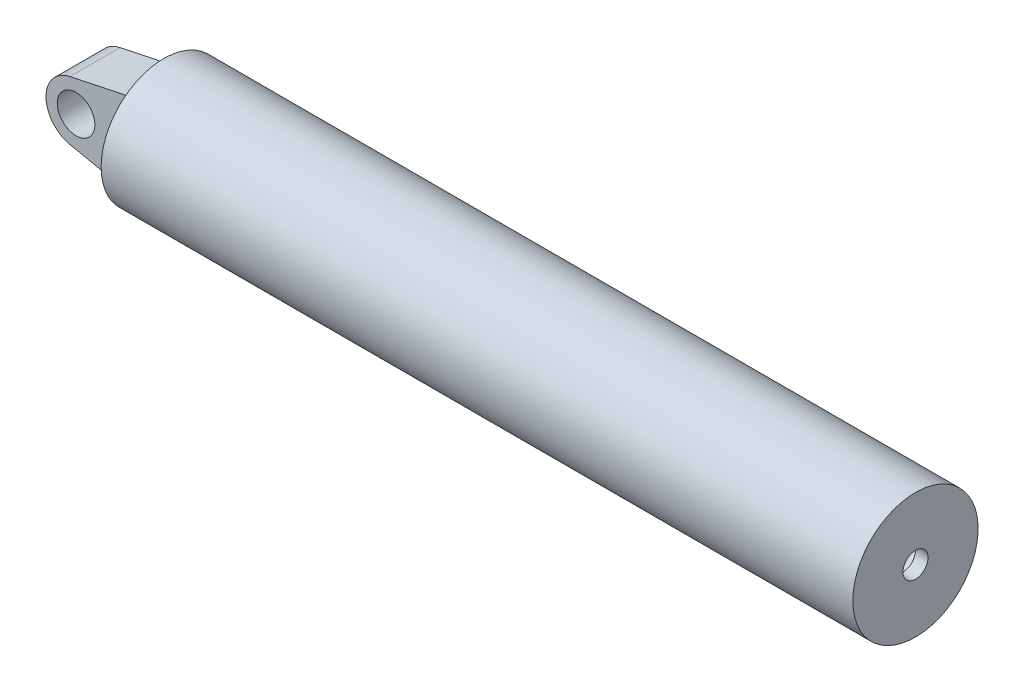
ISO-10303-21;
HEADER;
FILE_DESCRIPTION(('STEP AP214'),'2;1');
FILE_NAME('part.step','',(''),(''),'','','');
FILE_SCHEMA(('AUTOMOTIVE_DESIGN { 1 0 10303 214 1 1 1 1 }'));
ENDSEC;
DATA;
#1=APPLICATION_CONTEXT('core data for automotive mechanical design processes');
#2=APPLICATION_PROTOCOL_DEFINITION('international standard','automotive_design',2000,#1);
#3=PRODUCT_CONTEXT('',#1,'mechanical');
#4=PRODUCT('Part','Part','',(#3));
#5=PRODUCT_RELATED_PRODUCT_CATEGORY('part','',(#4));
#6=PRODUCT_DEFINITION_FORMATION('','',#4);
#7=PRODUCT_DEFINITION_CONTEXT('part definition',#1,'design');
#8=PRODUCT_DEFINITION('design','',#6,#7);
#9=PRODUCT_DEFINITION_SHAPE('','',#8);
#10=(LENGTH_UNIT() NAMED_UNIT(*) SI_UNIT(.MILLI.,.METRE.));
#11=(NAMED_UNIT(*) PLANE_ANGLE_UNIT() SI_UNIT($,.RADIAN.));
#12=(NAMED_UNIT(*) SI_UNIT($,.STERADIAN.) SOLID_ANGLE_UNIT());
#13=UNCERTAINTY_MEASURE_WITH_UNIT(LENGTH_MEASURE(1.E-05),#10,'distance_accuracy_value','');
#14=(GEOMETRIC_REPRESENTATION_CONTEXT(3) GLOBAL_UNCERTAINTY_ASSIGNED_CONTEXT((#13)) GLOBAL_UNIT_ASSIGNED_CONTEXT((#10,
#11,#12)) REPRESENTATION_CONTEXT('',''));
#15=CARTESIAN_POINT('',(0.,0.,0.));
#16=DIRECTION('',(0.,0.,1.));
#17=DIRECTION('',(1.,0.,0.));
#18=AXIS2_PLACEMENT_3D('',#15,#16,#17);
#19=CARTESIAN_POINT('',(-25.0000000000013,-1.71543922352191,9.99999999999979));
#20=DIRECTION('',(0.,0.,1.00000000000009));
#21=DIRECTION('',(1.00000000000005,0.,0.));
#22=AXIS2_PLACEMENT_3D('',#19,#20,#21);
#23=PLANE('',#22);
#24=DIRECTION('',(0.,-1.00000000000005,0.));
#25=VECTOR('',#24,1.);
#26=CARTESIAN_POINT('',(0.,15.7845607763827,9.99999999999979));
#27=LINE('',#26,#25);
#28=CARTESIAN_POINT('',(0.,15.7845607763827,9.99999999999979));
#29=VERTEX_POINT('',#28);
#30=CARTESIAN_POINT('',(-1.17961196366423E-12,-19.2154392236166,9.99999999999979));
#31=VERTEX_POINT('',#30);
#32=EDGE_CURVE('E33',#29,#31,#27,.T.);
#33=ORIENTED_EDGE('',*,*,#32,.F.);
#34=DIRECTION('',(-0.978737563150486,-0.205116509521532,0.));
#35=VECTOR('',#34,1.);
#36=CARTESIAN_POINT('',(0.,15.7845607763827,9.99999999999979));
#37=LINE('',#36,#35);
#38=CARTESIAN_POINT('',(-27.4613958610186,10.0294065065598,9.99999999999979));
#39=VERTEX_POINT('',#38);
#40=EDGE_CURVE('E59',#29,#39,#37,.T.);
#41=ORIENTED_EDGE('',*,*,#40,.T.);
#42=CARTESIAN_POINT('',(-25.0000000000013,-1.71543922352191,9.99999999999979));
#43=DIRECTION('',(0.,0.,1.00000000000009));
#44=DIRECTION('',(1.00000000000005,0.,0.));
#45=AXIS2_PLACEMENT_3D('',#42,#43,#44);
#46=CIRCLE('',#45,12.);
#47=CARTESIAN_POINT('',(-27.4613947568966,-13.4602906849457,9.99999999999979));
#48=VERTEX_POINT('',#47);
#49=EDGE_CURVE('E83',#39,#48,#46,.T.);
#50=ORIENTED_EDGE('',*,*,#49,.T.);
#51=DIRECTION('',(-0.978737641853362,0.20511613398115,0.));
#52=VECTOR('',#51,1.);
#53=CARTESIAN_POINT('',(-1.17961196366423E-12,-19.2154392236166,9.99999999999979));
#54=LINE('',#53,#52);
#55=EDGE_CURVE('E81',#31,#48,#54,.T.);
#56=ORIENTED_EDGE('',*,*,#55,.F.);
#57=EDGE_LOOP('',(#33,#41,#50,#56));
#58=FACE_BOUND('',#57,.T.);
#59=CARTESIAN_POINT('',(-25.0000000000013,-1.71543922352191,9.99999999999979));
#60=DIRECTION('',(0.,0.,1.00000000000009));
#61=DIRECTION('',(1.00000000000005,0.,0.));
#62=AXIS2_PLACEMENT_3D('',#59,#60,#61);
#63=CIRCLE('',#62,7.5);
#64=CARTESIAN_POINT('',(-17.5000000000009,-1.71543922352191,9.99999999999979));
#65=VERTEX_POINT('',#64);
#66=EDGE_CURVE('E71',#65,#65,#63,.T.);
#67=ORIENTED_EDGE('',*,*,#66,.F.);
#68=EDGE_LOOP('',(#67));
#69=FACE_BOUND('',#68,.T.);
#70=ADVANCED_FACE('F14',(#58,#69),#23,.T.);
#71=CARTESIAN_POINT('',(-25.0000000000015,-1.71543922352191,-9.99999999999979));
#72=DIRECTION('',(0.,0.,1.00000000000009));
#73=DIRECTION('',(1.00000000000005,0.,0.));
#74=AXIS2_PLACEMENT_3D('',#71,#72,#73);
#75=PLANE('',#74);
#76=DIRECTION('',(0.,-1.00000000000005,0.));
#77=VECTOR('',#76,1.);
#78=CARTESIAN_POINT('',(0.,15.7845607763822,-9.99999999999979));
#79=LINE('',#78,#77);
#80=CARTESIAN_POINT('',(0.,15.7845607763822,-9.99999999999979));
#81=VERTEX_POINT('',#80);
#82=CARTESIAN_POINT('',(-1.40165656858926E-12,-19.2154392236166,-9.99999999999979));
#83=VERTEX_POINT('',#82);
#84=EDGE_CURVE('E53',#81,#83,#79,.T.);
#85=ORIENTED_EDGE('',*,*,#84,.T.);
#86=DIRECTION('',(-0.978737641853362,0.20511613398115,0.));
#87=VECTOR('',#86,1.);
#88=CARTESIAN_POINT('',(-1.40165656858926E-12,-19.2154392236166,-9.99999999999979));
#89=LINE('',#88,#87);
#90=CARTESIAN_POINT('',(-27.4613947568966,-13.4602906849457,-9.99999999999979));
#91=VERTEX_POINT('',#90);
#92=EDGE_CURVE('E67',#83,#91,#89,.T.);
#93=ORIENTED_EDGE('',*,*,#92,.T.);
#94=CARTESIAN_POINT('',(-25.0000000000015,-1.71543922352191,-9.99999999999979));
#95=DIRECTION('',(0.,0.,1.00000000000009));
#96=DIRECTION('',(1.00000000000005,0.,0.));
#97=AXIS2_PLACEMENT_3D('',#94,#95,#96);
#98=CIRCLE('',#97,12.);
#99=CARTESIAN_POINT('',(-27.4613958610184,10.0294065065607,-9.99999999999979));
#100=VERTEX_POINT('',#99);
#101=EDGE_CURVE('E74',#100,#91,#98,.T.);
#102=ORIENTED_EDGE('',*,*,#101,.F.);
#103=DIRECTION('',(-0.978737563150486,-0.205116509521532,0.));
#104=VECTOR('',#103,1.);
#105=CARTESIAN_POINT('',(0.,15.7845607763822,-9.99999999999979));
#106=LINE('',#105,#104);
#107=EDGE_CURVE('E70',#81,#100,#106,.T.);
#108=ORIENTED_EDGE('',*,*,#107,.F.);
#109=EDGE_LOOP('',(#85,#93,#102,#108));
#110=FACE_BOUND('',#109,.T.);
#111=CARTESIAN_POINT('',(-25.0000000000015,-1.71543922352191,-9.99999999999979));
#112=DIRECTION('',(0.,0.,1.00000000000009));
#113=DIRECTION('',(1.00000000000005,0.,0.));
#114=AXIS2_PLACEMENT_3D('',#111,#112,#113);
#115=CIRCLE('',#114,7.5);
#116=CARTESIAN_POINT('',(-17.5000000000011,-1.71543922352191,-9.99999999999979));
#117=VERTEX_POINT('',#116);
#118=EDGE_CURVE('E247',#117,#117,#115,.T.);
#119=ORIENTED_EDGE('',*,*,#118,.T.);
#120=EDGE_LOOP('',(#119));
#121=FACE_BOUND('',#120,.T.);
#122=ADVANCED_FACE('F64',(#110,#121),#75,.F.);
#123=CARTESIAN_POINT('',(0.,15.7845607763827,9.99999999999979));
#124=DIRECTION('',(0.205116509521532,-0.978737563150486,0.));
#125=DIRECTION('',(0.978737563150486,0.205116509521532,0.));
#126=AXIS2_PLACEMENT_3D('',#123,#124,#125);
#127=PLANE('',#126);
#128=DIRECTION('',(0.,0.,-1.00000000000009));
#129=VECTOR('',#128,1.);
#130=CARTESIAN_POINT('',(-27.4613958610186,10.0294065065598,9.99999999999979));
#131=LINE('',#130,#129);
#132=EDGE_CURVE('E89',#39,#100,#131,.T.);
#133=ORIENTED_EDGE('',*,*,#132,.F.);
#134=ORIENTED_EDGE('',*,*,#40,.F.);
#135=DIRECTION('',(0.,0.,-1.00000000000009));
#136=VECTOR('',#135,1.);
#137=CARTESIAN_POINT('',(0.,15.7845607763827,9.99999999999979));
#138=LINE('',#137,#136);
#139=EDGE_CURVE('E29',#29,#81,#138,.T.);
#140=ORIENTED_EDGE('',*,*,#139,.T.);
#141=ORIENTED_EDGE('',*,*,#107,.T.);
#142=EDGE_LOOP('',(#133,#134,#140,#141));
#143=FACE_BOUND('',#142,.T.);
#144=ADVANCED_FACE('F128',(#143),#127,.F.);
#145=CARTESIAN_POINT('',(-25.0000000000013,-1.71543922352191,9.99999999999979));
#146=DIRECTION('',(0.,0.,-1.00000000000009));
#147=DIRECTION('',(-1.00000000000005,0.,0.));
#148=AXIS2_PLACEMENT_3D('',#145,#146,#147);
#149=CYLINDRICAL_SURFACE('',#148,12.);
#150=DIRECTION('',(0.,0.,-1.00000000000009));
#151=VECTOR('',#150,1.);
#152=CARTESIAN_POINT('',(-27.4613947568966,-13.4602906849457,9.99999999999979));
#153=LINE('',#152,#151);
#154=EDGE_CURVE('E58',#48,#91,#153,.T.);
#155=ORIENTED_EDGE('',*,*,#154,.F.);
#156=ORIENTED_EDGE('',*,*,#49,.F.);
#157=ORIENTED_EDGE('',*,*,#132,.T.);
#158=ORIENTED_EDGE('',*,*,#101,.T.);
#159=EDGE_LOOP('',(#155,#156,#157,#158));
#160=FACE_BOUND('',#159,.T.);
#161=ADVANCED_FACE('F136',(#160),#149,.T.);
#162=CARTESIAN_POINT('',(-1.17961196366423E-12,-19.2154392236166,9.99999999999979));
#163=DIRECTION('',(-0.20511613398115,-0.978737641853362,0.));
#164=DIRECTION('',(0.978737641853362,-0.20511613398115,0.));
#165=AXIS2_PLACEMENT_3D('',#162,#163,#164);
#166=PLANE('',#165);
#167=ORIENTED_EDGE('',*,*,#55,.T.);
#168=ORIENTED_EDGE('',*,*,#154,.T.);
#169=ORIENTED_EDGE('',*,*,#92,.F.);
#170=DIRECTION('',(0.,0.,-1.00000000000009));
#171=VECTOR('',#170,1.);
#172=CARTESIAN_POINT('',(-1.17961196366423E-12,-19.2154392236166,9.99999999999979));
#173=LINE('',#172,#171);
#174=EDGE_CURVE('E50',#31,#83,#173,.T.);
#175=ORIENTED_EDGE('',*,*,#174,.F.);
#176=EDGE_LOOP('',(#167,#168,#169,#175));
#177=FACE_BOUND('',#176,.T.);
#178=ADVANCED_FACE('F73',(#177),#166,.T.);
#179=CARTESIAN_POINT('',(-25.0000000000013,-1.71543922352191,9.99999999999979));
#180=DIRECTION('',(0.,0.,-1.00000000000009));
#181=DIRECTION('',(-1.00000000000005,0.,0.));
#182=AXIS2_PLACEMENT_3D('',#179,#180,#181);
#183=CYLINDRICAL_SURFACE('',#182,7.5);
#184=ORIENTED_EDGE('',*,*,#66,.T.);
#185=EDGE_LOOP('',(#184));
#186=FACE_BOUND('',#185,.T.);
#187=ORIENTED_EDGE('',*,*,#118,.F.);
#188=EDGE_LOOP('',(#187));
#189=FACE_BOUND('',#188,.T.);
#190=ADVANCED_FACE('F135',(#186,#189),#183,.F.);
#191=CARTESIAN_POINT('',(2.22044604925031E-13,8.88178419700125E-13,0.));
#192=DIRECTION('',(-1.00000000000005,0.,0.));
#193=DIRECTION('',(0.,0.,1.00000000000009));
#194=AXIS2_PLACEMENT_3D('',#191,#192,#193);
#195=PLANE('',#194);
#196=ORIENTED_EDGE('',*,*,#139,.F.);
#197=ORIENTED_EDGE('',*,*,#32,.T.);
#198=ORIENTED_EDGE('',*,*,#174,.T.);
#199=ORIENTED_EDGE('',*,*,#84,.F.);
#200=EDGE_LOOP('',(#196,#197,#198,#199));
#201=FACE_BOUND('',#200,.T.);
#202=CARTESIAN_POINT('',(2.22044604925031E-13,8.88178419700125E-13,0.));
#203=DIRECTION('',(-1.00000000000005,0.,0.));
#204=DIRECTION('',(0.,0.,1.00000000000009));
#205=AXIS2_PLACEMENT_3D('',#202,#203,#204);
#206=CIRCLE('',#205,25.);
#207=CARTESIAN_POINT('',(2.22044604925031E-13,8.88178419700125E-13,25.0000000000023));
#208=VERTEX_POINT('',#207);
#209=EDGE_CURVE('E9',#208,#208,#206,.T.);
#210=ORIENTED_EDGE('',*,*,#209,.T.);
#211=EDGE_LOOP('',(#210));
#212=FACE_BOUND('',#211,.T.);
#213=ADVANCED_FACE('F16',(#201,#212),#195,.T.);
#214=CARTESIAN_POINT('',(2.22044604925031E-13,8.88178419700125E-13,0.));
#215=DIRECTION('',(-1.00000000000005,0.,0.));
#216=DIRECTION('',(0.,0.,1.00000000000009));
#217=AXIS2_PLACEMENT_3D('',#214,#215,#216);
#218=CYLINDRICAL_SURFACE('',#217,25.);
#219=ORIENTED_EDGE('',*,*,#209,.F.);
#220=EDGE_LOOP('',(#219));
#221=FACE_BOUND('',#220,.T.);
#222=CARTESIAN_POINT('',(300.000000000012,0.,0.));
#223=DIRECTION('',(-1.00000000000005,0.,0.));
#224=DIRECTION('',(0.,0.,1.00000000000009));
#225=AXIS2_PLACEMENT_3D('',#222,#223,#224);
#226=CIRCLE('',#225,25.);
#227=CARTESIAN_POINT('',(300.000000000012,0.,25.0000000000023));
#228=VERTEX_POINT('',#227);
#229=EDGE_CURVE('E22',#228,#228,#226,.T.);
#230=ORIENTED_EDGE('',*,*,#229,.T.);
#231=EDGE_LOOP('',(#230));
#232=FACE_BOUND('',#231,.T.);
#233=ADVANCED_FACE('F106',(#221,#232),#218,.T.);
#234=CARTESIAN_POINT('',(300.000000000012,25.0000000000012,0.));
#235=DIRECTION('',(1.00000000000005,0.,0.));
#236=DIRECTION('',(0.,0.,-1.00000000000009));
#237=AXIS2_PLACEMENT_3D('',#234,#235,#236);
#238=PLANE('',#237);
#239=CARTESIAN_POINT('',(300.000000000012,0.,0.));
#240=DIRECTION('',(-1.00000000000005,0.,0.));
#241=DIRECTION('',(0.,0.,1.00000000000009));
#242=AXIS2_PLACEMENT_3D('',#239,#240,#241);
#243=CIRCLE('',#242,5.);
#244=CARTESIAN_POINT('',(300.000000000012,0.,5.00000000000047));
#245=VERTEX_POINT('',#244);
#246=EDGE_CURVE('E101',#245,#245,#243,.T.);
#247=ORIENTED_EDGE('',*,*,#246,.T.);
#248=EDGE_LOOP('',(#247));
#249=FACE_BOUND('',#248,.T.);
#250=ORIENTED_EDGE('',*,*,#229,.F.);
#251=EDGE_LOOP('',(#250));
#252=FACE_BOUND('',#251,.T.);
#253=ADVANCED_FACE('F108',(#249,#252),#238,.T.);
#254=CARTESIAN_POINT('',(2.22044604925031E-13,8.88178419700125E-13,0.));
#255=DIRECTION('',(-1.00000000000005,0.,0.));
#256=DIRECTION('',(0.,0.,1.00000000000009));
#257=AXIS2_PLACEMENT_3D('',#254,#255,#256);
#258=CYLINDRICAL_SURFACE('',#257,5.);
#259=ORIENTED_EDGE('',*,*,#246,.F.);
#260=EDGE_LOOP('',(#259));
#261=FACE_BOUND('',#260,.T.);
#262=CARTESIAN_POINT('',(295.000000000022,-4.21884749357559E-11,0.));
#263=DIRECTION('',(-1.00000000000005,0.,0.));
#264=DIRECTION('',(0.,0.,1.00000000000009));
#265=AXIS2_PLACEMENT_3D('',#262,#263,#264);
#266=CIRCLE('',#265,5.);
#267=CARTESIAN_POINT('',(295.000000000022,-4.21884749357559E-11,5.00000000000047));
#268=VERTEX_POINT('',#267);
#269=EDGE_CURVE('E98',#268,#268,#266,.T.);
#270=ORIENTED_EDGE('',*,*,#269,.T.);
#271=EDGE_LOOP('',(#270));
#272=FACE_BOUND('',#271,.T.);
#273=ADVANCED_FACE('F110',(#261,#272),#258,.F.);
#274=CARTESIAN_POINT('',(295.000000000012,19.9999999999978,0.));
#275=DIRECTION('',(1.00000000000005,0.,0.));
#276=DIRECTION('',(0.,0.,-1.00000000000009));
#277=AXIS2_PLACEMENT_3D('',#274,#275,#276);
#278=PLANE('',#277);
#279=ORIENTED_EDGE('',*,*,#269,.F.);
#280=EDGE_LOOP('',(#279));
#281=FACE_BOUND('',#280,.T.);
#282=CARTESIAN_POINT('',(295.000000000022,-4.21884749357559E-11,0.));
#283=DIRECTION('',(-1.00000000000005,0.,0.));
#284=DIRECTION('',(0.,0.,1.00000000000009));
#285=AXIS2_PLACEMENT_3D('',#282,#283,#284);
#286=CIRCLE('',#285,20.);
#287=CARTESIAN_POINT('',(295.000000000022,-4.21884749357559E-11,20.0000000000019));
#288=VERTEX_POINT('',#287);
#289=EDGE_CURVE('E95',#288,#288,#286,.T.);
#290=ORIENTED_EDGE('',*,*,#289,.T.);
#291=EDGE_LOOP('',(#290));
#292=FACE_BOUND('',#291,.T.);
#293=ADVANCED_FACE('F118',(#281,#292),#278,.F.);
#294=CARTESIAN_POINT('',(2.22044604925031E-13,8.88178419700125E-13,0.));
#295=DIRECTION('',(-1.00000000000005,0.,0.));
#296=DIRECTION('',(0.,0.,1.00000000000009));
#297=AXIS2_PLACEMENT_3D('',#294,#295,#296);
#298=CYLINDRICAL_SURFACE('',#297,20.);
#299=CARTESIAN_POINT('',(9.99999999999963,-9.59232693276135E-11,0.));
#300=DIRECTION('',(-1.00000000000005,0.,0.));
#301=DIRECTION('',(0.,0.,1.00000000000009));
#302=AXIS2_PLACEMENT_3D('',#299,#300,#301);
#303=CIRCLE('',#302,20.);
#304=CARTESIAN_POINT('',(9.99999999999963,-9.59232693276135E-11,20.0000000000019));
#305=VERTEX_POINT('',#304);
#306=EDGE_CURVE('E92',#305,#305,#303,.T.);
#307=ORIENTED_EDGE('',*,*,#306,.T.);
#308=EDGE_LOOP('',(#307));
#309=FACE_BOUND('',#308,.T.);
#310=ORIENTED_EDGE('',*,*,#289,.F.);
#311=EDGE_LOOP('',(#310));
#312=FACE_BOUND('',#311,.T.);
#313=ADVANCED_FACE('F146',(#309,#312),#298,.F.);
#314=CARTESIAN_POINT('',(9.99999999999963,-9.59232693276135E-11,0.));
#315=DIRECTION('',(-1.00000000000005,0.,0.));
#316=DIRECTION('',(0.,0.,1.00000000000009));
#317=AXIS2_PLACEMENT_3D('',#314,#315,#316);
#318=PLANE('',#317);
#319=ORIENTED_EDGE('',*,*,#306,.F.);
#320=EDGE_LOOP('',(#319));
#321=FACE_BOUND('',#320,.T.);
#322=ADVANCED_FACE('F143',(#321),#318,.F.);
#323=CLOSED_SHELL('',(#70,#122,#144,#161,#178,#190,#213,#233,#253,#273,#293,#313,#322));
#324=MANIFOLD_SOLID_BREP('B1',#323);
#325=ADVANCED_BREP_SHAPE_REPRESENTATION('',(#18,#324),#14);
#326=SHAPE_DEFINITION_REPRESENTATION(#9,#325);
ENDSEC;
END-ISO-10303-21;
